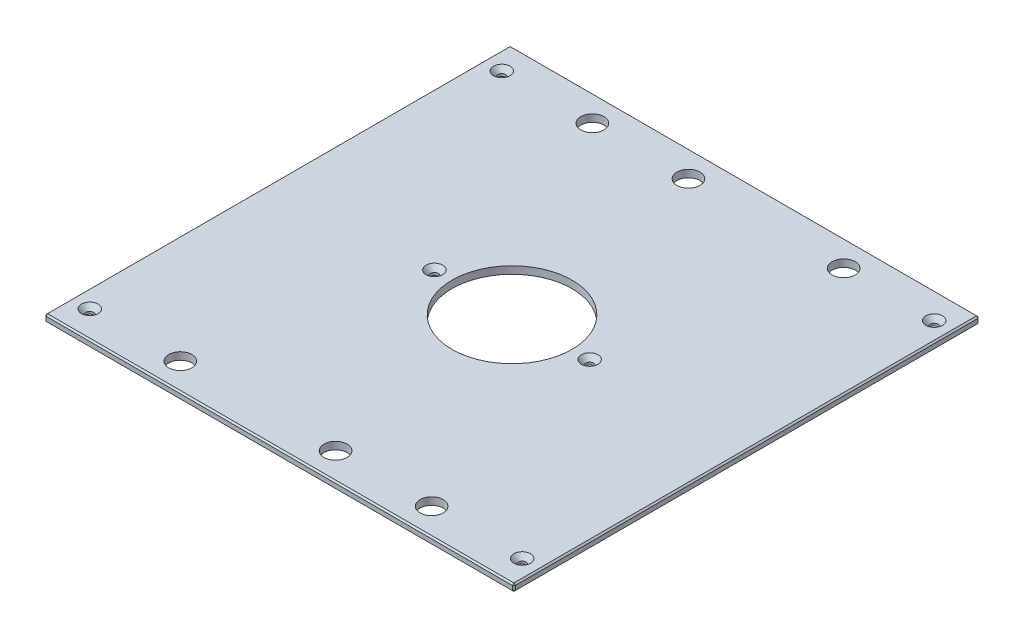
ISO-10303-21;
HEADER;
FILE_DESCRIPTION(('STEP AP214'),'2;1');
FILE_NAME('part.step','',(''),(''),'','','');
FILE_SCHEMA(('AUTOMOTIVE_DESIGN { 1 0 10303 214 1 1 1 1 }'));
ENDSEC;
DATA;
#1=APPLICATION_CONTEXT('core data for automotive mechanical design processes');
#2=APPLICATION_PROTOCOL_DEFINITION('international standard','automotive_design',2000,#1);
#3=PRODUCT_CONTEXT('',#1,'mechanical');
#4=PRODUCT('Part','Part','',(#3));
#5=PRODUCT_RELATED_PRODUCT_CATEGORY('part','',(#4));
#6=PRODUCT_DEFINITION_FORMATION('','',#4);
#7=PRODUCT_DEFINITION_CONTEXT('part definition',#1,'design');
#8=PRODUCT_DEFINITION('design','',#6,#7);
#9=PRODUCT_DEFINITION_SHAPE('','',#8);
#10=(LENGTH_UNIT() NAMED_UNIT(*) SI_UNIT(.MILLI.,.METRE.));
#11=(NAMED_UNIT(*) PLANE_ANGLE_UNIT() SI_UNIT($,.RADIAN.));
#12=(NAMED_UNIT(*) SI_UNIT($,.STERADIAN.) SOLID_ANGLE_UNIT());
#13=UNCERTAINTY_MEASURE_WITH_UNIT(LENGTH_MEASURE(1.E-05),#10,'distance_accuracy_value','');
#14=(GEOMETRIC_REPRESENTATION_CONTEXT(3) GLOBAL_UNCERTAINTY_ASSIGNED_CONTEXT((#13)) GLOBAL_UNIT_ASSIGNED_CONTEXT((#10,
#11,#12)) REPRESENTATION_CONTEXT('',''));
#15=CARTESIAN_POINT('',(0.,0.,0.));
#16=DIRECTION('',(0.,0.,1.));
#17=DIRECTION('',(1.,0.,0.));
#18=AXIS2_PLACEMENT_3D('',#15,#16,#17);
#19=CARTESIAN_POINT('',(-201.6125,6.35,-200.025));
#20=DIRECTION('',(1.,0.,0.));
#21=DIRECTION('',(0.,0.,-1.));
#22=AXIS2_PLACEMENT_3D('',#19,#20,#21);
#23=PLANE('',#22);
#24=DIRECTION('',(0.,0.,-1.));
#25=VECTOR('',#24,1.);
#26=CARTESIAN_POINT('',(-201.6125,5.08000000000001,-200.025));
#27=LINE('',#26,#25);
#28=CARTESIAN_POINT('',(-201.6125,5.08000000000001,198.755));
#29=VERTEX_POINT('',#28);
#30=CARTESIAN_POINT('',(-201.6125,5.08000000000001,-198.755));
#31=VERTEX_POINT('',#30);
#32=EDGE_CURVE('E135',#29,#31,#27,.T.);
#33=ORIENTED_EDGE('',*,*,#32,.T.);
#34=DIRECTION('',(0.,-1.,0.));
#35=VECTOR('',#34,1.);
#36=CARTESIAN_POINT('',(-201.6125,6.35,-198.755));
#37=LINE('',#36,#35);
#38=CARTESIAN_POINT('',(-201.6125,1.26999999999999,-198.755));
#39=VERTEX_POINT('',#38);
#40=EDGE_CURVE('E131',#31,#39,#37,.T.);
#41=ORIENTED_EDGE('',*,*,#40,.T.);
#42=DIRECTION('',(0.,0.,1.));
#43=VECTOR('',#42,1.);
#44=CARTESIAN_POINT('',(-201.6125,1.26999999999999,-200.025));
#45=LINE('',#44,#43);
#46=CARTESIAN_POINT('',(-201.6125,1.26999999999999,198.755));
#47=VERTEX_POINT('',#46);
#48=EDGE_CURVE('E126',#39,#47,#45,.T.);
#49=ORIENTED_EDGE('',*,*,#48,.T.);
#50=DIRECTION('',(0.,1.,0.));
#51=VECTOR('',#50,1.);
#52=CARTESIAN_POINT('',(-201.6125,6.35,198.755));
#53=LINE('',#52,#51);
#54=EDGE_CURVE('E128',#47,#29,#53,.T.);
#55=ORIENTED_EDGE('',*,*,#54,.T.);
#56=EDGE_LOOP('',(#33,#41,#49,#55));
#57=FACE_BOUND('',#56,.T.);
#58=ADVANCED_FACE('F35',(#57),#23,.F.);
#59=CARTESIAN_POINT('',(-201.6125,6.35,200.025));
#60=DIRECTION('',(0.,0.,-1.));
#61=DIRECTION('',(-1.,0.,0.));
#62=AXIS2_PLACEMENT_3D('',#59,#60,#61);
#63=PLANE('',#62);
#64=DIRECTION('',(1.,0.,0.));
#65=VECTOR('',#64,1.);
#66=CARTESIAN_POINT('',(-201.6125,1.26999999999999,200.025));
#67=LINE('',#66,#65);
#68=CARTESIAN_POINT('',(-200.3425,1.26999999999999,200.025));
#69=VERTEX_POINT('',#68);
#70=CARTESIAN_POINT('',(200.3425,1.26999999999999,200.025));
#71=VERTEX_POINT('',#70);
#72=EDGE_CURVE('E58',#69,#71,#67,.T.);
#73=ORIENTED_EDGE('',*,*,#72,.T.);
#74=DIRECTION('',(0.,1.,0.));
#75=VECTOR('',#74,1.);
#76=CARTESIAN_POINT('',(200.3425,6.35,200.025));
#77=LINE('',#76,#75);
#78=CARTESIAN_POINT('',(200.3425,5.08000000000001,200.025));
#79=VERTEX_POINT('',#78);
#80=EDGE_CURVE('E11',#71,#79,#77,.T.);
#81=ORIENTED_EDGE('',*,*,#80,.T.);
#82=DIRECTION('',(-1.,0.,0.));
#83=VECTOR('',#82,1.);
#84=CARTESIAN_POINT('',(-201.6125,5.08000000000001,200.025));
#85=LINE('',#84,#83);
#86=CARTESIAN_POINT('',(-200.3425,5.08000000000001,200.025));
#87=VERTEX_POINT('',#86);
#88=EDGE_CURVE('E44',#79,#87,#85,.T.);
#89=ORIENTED_EDGE('',*,*,#88,.T.);
#90=DIRECTION('',(0.,-1.,0.));
#91=VECTOR('',#90,1.);
#92=CARTESIAN_POINT('',(-200.3425,6.35,200.025));
#93=LINE('',#92,#91);
#94=EDGE_CURVE('E291',#87,#69,#93,.T.);
#95=ORIENTED_EDGE('',*,*,#94,.T.);
#96=EDGE_LOOP('',(#73,#81,#89,#95));
#97=FACE_BOUND('',#96,.T.);
#98=ADVANCED_FACE('F360',(#97),#63,.F.);
#99=CARTESIAN_POINT('',(201.6125,6.35,-200.025));
#100=DIRECTION('',(-1.,0.,0.));
#101=DIRECTION('',(0.,0.,1.));
#102=AXIS2_PLACEMENT_3D('',#99,#100,#101);
#103=PLANE('',#102);
#104=DIRECTION('',(0.,0.,-1.));
#105=VECTOR('',#104,1.);
#106=CARTESIAN_POINT('',(201.6125,1.26999999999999,-200.025));
#107=LINE('',#106,#105);
#108=CARTESIAN_POINT('',(201.6125,1.26999999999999,198.755));
#109=VERTEX_POINT('',#108);
#110=CARTESIAN_POINT('',(201.6125,1.26999999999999,-198.755));
#111=VERTEX_POINT('',#110);
#112=EDGE_CURVE('E286',#109,#111,#107,.T.);
#113=ORIENTED_EDGE('',*,*,#112,.T.);
#114=DIRECTION('',(0.,1.,0.));
#115=VECTOR('',#114,1.);
#116=CARTESIAN_POINT('',(201.6125,6.35,-198.755));
#117=LINE('',#116,#115);
#118=CARTESIAN_POINT('',(201.6125,5.08000000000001,-198.755));
#119=VERTEX_POINT('',#118);
#120=EDGE_CURVE('E288',#111,#119,#117,.T.);
#121=ORIENTED_EDGE('',*,*,#120,.T.);
#122=DIRECTION('',(0.,0.,1.));
#123=VECTOR('',#122,1.);
#124=CARTESIAN_POINT('',(201.6125,5.08000000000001,200.025));
#125=LINE('',#124,#123);
#126=CARTESIAN_POINT('',(201.6125,5.08000000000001,198.755));
#127=VERTEX_POINT('',#126);
#128=EDGE_CURVE('E284',#119,#127,#125,.T.);
#129=ORIENTED_EDGE('',*,*,#128,.T.);
#130=DIRECTION('',(0.,-1.,0.));
#131=VECTOR('',#130,1.);
#132=CARTESIAN_POINT('',(201.6125,6.35,198.755));
#133=LINE('',#132,#131);
#134=EDGE_CURVE('E282',#127,#109,#133,.T.);
#135=ORIENTED_EDGE('',*,*,#134,.T.);
#136=EDGE_LOOP('',(#113,#121,#129,#135));
#137=FACE_BOUND('',#136,.T.);
#138=ADVANCED_FACE('F347',(#137),#103,.F.);
#139=CARTESIAN_POINT('',(-201.6125,6.35,-200.025));
#140=DIRECTION('',(0.,0.,1.));
#141=DIRECTION('',(1.,0.,0.));
#142=AXIS2_PLACEMENT_3D('',#139,#140,#141);
#143=PLANE('',#142);
#144=DIRECTION('',(-1.,0.,0.));
#145=VECTOR('',#144,1.);
#146=CARTESIAN_POINT('',(-201.6125,1.26999999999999,-200.025));
#147=LINE('',#146,#145);
#148=CARTESIAN_POINT('',(200.3425,1.26999999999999,-200.025));
#149=VERTEX_POINT('',#148);
#150=CARTESIAN_POINT('',(-200.3425,1.26999999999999,-200.025));
#151=VERTEX_POINT('',#150);
#152=EDGE_CURVE('E258',#149,#151,#147,.T.);
#153=ORIENTED_EDGE('',*,*,#152,.T.);
#154=DIRECTION('',(0.,1.,0.));
#155=VECTOR('',#154,1.);
#156=CARTESIAN_POINT('',(-200.3425,6.35,-200.025));
#157=LINE('',#156,#155);
#158=CARTESIAN_POINT('',(-200.3425,5.08000000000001,-200.025));
#159=VERTEX_POINT('',#158);
#160=EDGE_CURVE('E262',#151,#159,#157,.T.);
#161=ORIENTED_EDGE('',*,*,#160,.T.);
#162=DIRECTION('',(1.,0.,0.));
#163=VECTOR('',#162,1.);
#164=CARTESIAN_POINT('',(201.6125,5.08000000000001,-200.025));
#165=LINE('',#164,#163);
#166=CARTESIAN_POINT('',(200.3425,5.08000000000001,-200.025));
#167=VERTEX_POINT('',#166);
#168=EDGE_CURVE('E260',#159,#167,#165,.T.);
#169=ORIENTED_EDGE('',*,*,#168,.T.);
#170=DIRECTION('',(0.,-1.,0.));
#171=VECTOR('',#170,1.);
#172=CARTESIAN_POINT('',(200.3425,6.35,-200.025));
#173=LINE('',#172,#171);
#174=EDGE_CURVE('E256',#167,#149,#173,.T.);
#175=ORIENTED_EDGE('',*,*,#174,.T.);
#176=EDGE_LOOP('',(#153,#161,#169,#175));
#177=FACE_BOUND('',#176,.T.);
#178=ADVANCED_FACE('F321',(#177),#143,.F.);
#179=CARTESIAN_POINT('',(0.,6.35,0.));
#180=DIRECTION('',(0.,1.,0.));
#181=DIRECTION('',(0.,0.,1.));
#182=AXIS2_PLACEMENT_3D('',#179,#180,#181);
#183=PLANE('',#182);
#184=CARTESIAN_POINT('',(185.7375,6.35,-177.00498));
#185=DIRECTION('',(0.,1.,0.));
#186=DIRECTION('',(0.,0.,1.));
#187=AXIS2_PLACEMENT_3D('',#184,#185,#186);
#188=CIRCLE('',#187,7.13739999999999);
#189=CARTESIAN_POINT('',(185.7375,6.35,-169.86758));
#190=VERTEX_POINT('',#189);
#191=EDGE_CURVE('E784',#190,#190,#188,.T.);
#192=ORIENTED_EDGE('',*,*,#191,.F.);
#193=EDGE_LOOP('',(#192));
#194=FACE_BOUND('',#193,.T.);
#195=CARTESIAN_POINT('',(185.7375,6.35,177.00498));
#196=DIRECTION('',(0.,1.,0.));
#197=DIRECTION('',(0.,0.,1.));
#198=AXIS2_PLACEMENT_3D('',#195,#196,#197);
#199=CIRCLE('',#198,7.13739999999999);
#200=CARTESIAN_POINT('',(185.7375,6.35,184.14238));
#201=VERTEX_POINT('',#200);
#202=EDGE_CURVE('E788',#201,#201,#199,.T.);
#203=ORIENTED_EDGE('',*,*,#202,.F.);
#204=EDGE_LOOP('',(#203));
#205=FACE_BOUND('',#204,.T.);
#206=CARTESIAN_POINT('',(-185.7375,6.35,177.00498));
#207=DIRECTION('',(0.,1.,0.));
#208=DIRECTION('',(0.,0.,1.));
#209=AXIS2_PLACEMENT_3D('',#206,#207,#208);
#210=CIRCLE('',#209,7.13739999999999);
#211=CARTESIAN_POINT('',(-185.7375,6.35,184.14238));
#212=VERTEX_POINT('',#211);
#213=EDGE_CURVE('E792',#212,#212,#210,.T.);
#214=ORIENTED_EDGE('',*,*,#213,.F.);
#215=EDGE_LOOP('',(#214));
#216=FACE_BOUND('',#215,.T.);
#217=CARTESIAN_POINT('',(-66.675,6.35,0.));
#218=DIRECTION('',(0.,1.,0.));
#219=DIRECTION('',(0.,0.,1.));
#220=AXIS2_PLACEMENT_3D('',#217,#218,#219);
#221=CIRCLE('',#220,7.1374);
#222=CARTESIAN_POINT('',(-66.675,6.35,7.1374));
#223=VERTEX_POINT('',#222);
#224=EDGE_CURVE('E796',#223,#223,#221,.T.);
#225=ORIENTED_EDGE('',*,*,#224,.F.);
#226=EDGE_LOOP('',(#225));
#227=FACE_BOUND('',#226,.T.);
#228=CARTESIAN_POINT('',(66.675,6.35,0.));
#229=DIRECTION('',(0.,1.,0.));
#230=DIRECTION('',(0.,0.,1.));
#231=AXIS2_PLACEMENT_3D('',#228,#229,#230);
#232=CIRCLE('',#231,7.1374);
#233=CARTESIAN_POINT('',(66.675,6.35,7.1374));
#234=VERTEX_POINT('',#233);
#235=EDGE_CURVE('E800',#234,#234,#232,.T.);
#236=ORIENTED_EDGE('',*,*,#235,.F.);
#237=EDGE_LOOP('',(#236));
#238=FACE_BOUND('',#237,.T.);
#239=CARTESIAN_POINT('',(-185.7375,6.35,-177.00498));
#240=DIRECTION('',(0.,1.,0.));
#241=DIRECTION('',(0.,0.,1.));
#242=AXIS2_PLACEMENT_3D('',#239,#240,#241);
#243=CIRCLE('',#242,7.13739999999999);
#244=CARTESIAN_POINT('',(-185.7375,6.35,-169.86758));
#245=VERTEX_POINT('',#244);
#246=EDGE_CURVE('E803',#245,#245,#243,.T.);
#247=ORIENTED_EDGE('',*,*,#246,.F.);
#248=EDGE_LOOP('',(#247));
#249=FACE_BOUND('',#248,.T.);
#250=DIRECTION('',(0.,0.,-1.));
#251=VECTOR('',#250,1.);
#252=CARTESIAN_POINT('',(200.3425,6.35,-200.025));
#253=LINE('',#252,#251);
#254=CARTESIAN_POINT('',(200.3425,6.35,198.755));
#255=VERTEX_POINT('',#254);
#256=CARTESIAN_POINT('',(200.3425,6.35,-198.755));
#257=VERTEX_POINT('',#256);
#258=EDGE_CURVE('E269',#255,#257,#253,.T.);
#259=ORIENTED_EDGE('',*,*,#258,.T.);
#260=DIRECTION('',(-1.,0.,0.));
#261=VECTOR('',#260,1.);
#262=CARTESIAN_POINT('',(-201.6125,6.35,-198.755));
#263=LINE('',#262,#261);
#264=CARTESIAN_POINT('',(-200.3425,6.35,-198.755));
#265=VERTEX_POINT('',#264);
#266=EDGE_CURVE('E271',#257,#265,#263,.T.);
#267=ORIENTED_EDGE('',*,*,#266,.T.);
#268=DIRECTION('',(0.,0.,1.));
#269=VECTOR('',#268,1.);
#270=CARTESIAN_POINT('',(-200.3425,6.35,200.025));
#271=LINE('',#270,#269);
#272=CARTESIAN_POINT('',(-200.3425,6.35,198.755));
#273=VERTEX_POINT('',#272);
#274=EDGE_CURVE('E267',#265,#273,#271,.T.);
#275=ORIENTED_EDGE('',*,*,#274,.T.);
#276=DIRECTION('',(1.,0.,0.));
#277=VECTOR('',#276,1.);
#278=CARTESIAN_POINT('',(201.6125,6.35,198.755));
#279=LINE('',#278,#277);
#280=EDGE_CURVE('E265',#273,#255,#279,.T.);
#281=ORIENTED_EDGE('',*,*,#280,.T.);
#282=EDGE_LOOP('',(#259,#267,#275,#281));
#283=FACE_BOUND('',#282,.T.);
#284=CARTESIAN_POINT('',(107.95,6.35,-177.00498));
#285=DIRECTION('',(0.,1.,0.));
#286=DIRECTION('',(0.,0.,1.));
#287=AXIS2_PLACEMENT_3D('',#284,#285,#286);
#288=CIRCLE('',#287,9.921875);
#289=CARTESIAN_POINT('',(107.95,6.35,-167.083105));
#290=VERTEX_POINT('',#289);
#291=EDGE_CURVE('E204',#290,#290,#288,.T.);
#292=ORIENTED_EDGE('',*,*,#291,.F.);
#293=EDGE_LOOP('',(#292));
#294=FACE_BOUND('',#293,.T.);
#295=CARTESIAN_POINT('',(-107.95,6.35,-177.00498));
#296=DIRECTION('',(0.,1.,0.));
#297=DIRECTION('',(0.,0.,1.));
#298=AXIS2_PLACEMENT_3D('',#295,#296,#297);
#299=CIRCLE('',#298,9.921875);
#300=CARTESIAN_POINT('',(-107.95,6.35,-167.083105));
#301=VERTEX_POINT('',#300);
#302=EDGE_CURVE('E214',#301,#301,#299,.T.);
#303=ORIENTED_EDGE('',*,*,#302,.F.);
#304=EDGE_LOOP('',(#303));
#305=FACE_BOUND('',#304,.T.);
#306=CARTESIAN_POINT('',(107.95,6.35,177.00498));
#307=DIRECTION('',(0.,1.,0.));
#308=DIRECTION('',(0.,0.,1.));
#309=AXIS2_PLACEMENT_3D('',#306,#307,#308);
#310=CIRCLE('',#309,9.921875);
#311=CARTESIAN_POINT('',(107.95,6.35,186.926855));
#312=VERTEX_POINT('',#311);
#313=EDGE_CURVE('E225',#312,#312,#310,.T.);
#314=ORIENTED_EDGE('',*,*,#313,.F.);
#315=EDGE_LOOP('',(#314));
#316=FACE_BOUND('',#315,.T.);
#317=CARTESIAN_POINT('',(-107.95,6.35,177.00498));
#318=DIRECTION('',(0.,1.,0.));
#319=DIRECTION('',(0.,0.,1.));
#320=AXIS2_PLACEMENT_3D('',#317,#318,#319);
#321=CIRCLE('',#320,9.921875);
#322=CARTESIAN_POINT('',(-107.95,6.35,186.926855));
#323=VERTEX_POINT('',#322);
#324=EDGE_CURVE('E231',#323,#323,#321,.T.);
#325=ORIENTED_EDGE('',*,*,#324,.F.);
#326=EDGE_LOOP('',(#325));
#327=FACE_BOUND('',#326,.T.);
#328=CARTESIAN_POINT('',(-25.4,6.35,-177.00498));
#329=DIRECTION('',(0.,1.,0.));
#330=DIRECTION('',(0.,0.,1.));
#331=AXIS2_PLACEMENT_3D('',#328,#329,#330);
#332=CIRCLE('',#331,9.921875);
#333=CARTESIAN_POINT('',(-25.4,6.35,-167.083105));
#334=VERTEX_POINT('',#333);
#335=EDGE_CURVE('E237',#334,#334,#332,.T.);
#336=ORIENTED_EDGE('',*,*,#335,.F.);
#337=EDGE_LOOP('',(#336));
#338=FACE_BOUND('',#337,.T.);
#339=CARTESIAN_POINT('',(25.4,6.35,177.00498));
#340=DIRECTION('',(0.,1.,0.));
#341=DIRECTION('',(0.,0.,1.));
#342=AXIS2_PLACEMENT_3D('',#339,#340,#341);
#343=CIRCLE('',#342,9.921875);
#344=CARTESIAN_POINT('',(25.4,6.35,186.926855));
#345=VERTEX_POINT('',#344);
#346=EDGE_CURVE('E243',#345,#345,#343,.T.);
#347=ORIENTED_EDGE('',*,*,#346,.F.);
#348=EDGE_LOOP('',(#347));
#349=FACE_BOUND('',#348,.T.);
#350=CARTESIAN_POINT('',(0.,6.35,0.));
#351=DIRECTION('',(0.,1.,0.));
#352=DIRECTION('',(0.,0.,1.));
#353=AXIS2_PLACEMENT_3D('',#350,#351,#352);
#354=CIRCLE('',#353,51.562);
#355=CARTESIAN_POINT('',(0.,6.35,51.562));
#356=VERTEX_POINT('',#355);
#357=EDGE_CURVE('E249',#356,#356,#354,.T.);
#358=ORIENTED_EDGE('',*,*,#357,.F.);
#359=EDGE_LOOP('',(#358));
#360=FACE_BOUND('',#359,.T.);
#361=ADVANCED_FACE('F369',(#194,#205,#216,#227,#238,#249,#283,#294,#305,#316,#327,#338,#349,
#360),#183,.T.);
#362=CARTESIAN_POINT('',(0.,0.,0.));
#363=DIRECTION('',(0.,1.,0.));
#364=DIRECTION('',(0.,0.,1.));
#365=AXIS2_PLACEMENT_3D('',#362,#363,#364);
#366=PLANE('',#365);
#367=CARTESIAN_POINT('',(185.7375,0.,-177.00498));
#368=DIRECTION('',(0.,1.,0.));
#369=DIRECTION('',(0.,0.,1.));
#370=AXIS2_PLACEMENT_3D('',#367,#368,#369);
#371=CIRCLE('',#370,3.3782);
#372=CARTESIAN_POINT('',(185.7375,0.,-173.62678));
#373=VERTEX_POINT('',#372);
#374=EDGE_CURVE('E837',#373,#373,#371,.T.);
#375=ORIENTED_EDGE('',*,*,#374,.T.);
#376=EDGE_LOOP('',(#375));
#377=FACE_BOUND('',#376,.T.);
#378=CARTESIAN_POINT('',(185.7375,0.,177.00498));
#379=DIRECTION('',(0.,1.,0.));
#380=DIRECTION('',(0.,0.,1.));
#381=AXIS2_PLACEMENT_3D('',#378,#379,#380);
#382=CIRCLE('',#381,3.3782);
#383=CARTESIAN_POINT('',(185.7375,0.,180.38318));
#384=VERTEX_POINT('',#383);
#385=EDGE_CURVE('E830',#384,#384,#382,.T.);
#386=ORIENTED_EDGE('',*,*,#385,.T.);
#387=EDGE_LOOP('',(#386));
#388=FACE_BOUND('',#387,.T.);
#389=CARTESIAN_POINT('',(-185.7375,0.,177.00498));
#390=DIRECTION('',(0.,1.,0.));
#391=DIRECTION('',(0.,0.,1.));
#392=AXIS2_PLACEMENT_3D('',#389,#390,#391);
#393=CIRCLE('',#392,3.3782);
#394=CARTESIAN_POINT('',(-185.7375,0.,180.38318));
#395=VERTEX_POINT('',#394);
#396=EDGE_CURVE('E823',#395,#395,#393,.T.);
#397=ORIENTED_EDGE('',*,*,#396,.T.);
#398=EDGE_LOOP('',(#397));
#399=FACE_BOUND('',#398,.T.);
#400=CARTESIAN_POINT('',(-66.675,0.,0.));
#401=DIRECTION('',(0.,1.,0.));
#402=DIRECTION('',(0.,0.,1.));
#403=AXIS2_PLACEMENT_3D('',#400,#401,#402);
#404=CIRCLE('',#403,3.3782);
#405=CARTESIAN_POINT('',(-66.675,0.,3.3782));
#406=VERTEX_POINT('',#405);
#407=EDGE_CURVE('E816',#406,#406,#404,.T.);
#408=ORIENTED_EDGE('',*,*,#407,.T.);
#409=EDGE_LOOP('',(#408));
#410=FACE_BOUND('',#409,.T.);
#411=CARTESIAN_POINT('',(66.675,0.,0.));
#412=DIRECTION('',(0.,1.,0.));
#413=DIRECTION('',(0.,0.,1.));
#414=AXIS2_PLACEMENT_3D('',#411,#412,#413);
#415=CIRCLE('',#414,3.3782);
#416=CARTESIAN_POINT('',(66.675,0.,3.3782));
#417=VERTEX_POINT('',#416);
#418=EDGE_CURVE('E806',#417,#417,#415,.T.);
#419=ORIENTED_EDGE('',*,*,#418,.T.);
#420=EDGE_LOOP('',(#419));
#421=FACE_BOUND('',#420,.T.);
#422=CARTESIAN_POINT('',(-185.7375,0.,-177.00498));
#423=DIRECTION('',(0.,1.,0.));
#424=DIRECTION('',(0.,0.,1.));
#425=AXIS2_PLACEMENT_3D('',#422,#423,#424);
#426=CIRCLE('',#425,3.3782);
#427=CARTESIAN_POINT('',(-185.7375,0.,-173.62678));
#428=VERTEX_POINT('',#427);
#429=EDGE_CURVE('E217',#428,#428,#426,.T.);
#430=ORIENTED_EDGE('',*,*,#429,.T.);
#431=EDGE_LOOP('',(#430));
#432=FACE_BOUND('',#431,.T.);
#433=DIRECTION('',(0.,0.,-1.));
#434=VECTOR('',#433,1.);
#435=CARTESIAN_POINT('',(-200.3425,0.,0.));
#436=LINE('',#435,#434);
#437=CARTESIAN_POINT('',(-200.3425,0.,198.755));
#438=VERTEX_POINT('',#437);
#439=CARTESIAN_POINT('',(-200.3425,0.,-198.755));
#440=VERTEX_POINT('',#439);
#441=EDGE_CURVE('E158',#438,#440,#436,.T.);
#442=ORIENTED_EDGE('',*,*,#441,.T.);
#443=DIRECTION('',(1.,0.,0.));
#444=VECTOR('',#443,1.);
#445=CARTESIAN_POINT('',(0.,0.,-198.755));
#446=LINE('',#445,#444);
#447=CARTESIAN_POINT('',(200.3425,0.,-198.755));
#448=VERTEX_POINT('',#447);
#449=EDGE_CURVE('E279',#440,#448,#446,.T.);
#450=ORIENTED_EDGE('',*,*,#449,.T.);
#451=DIRECTION('',(0.,0.,1.));
#452=VECTOR('',#451,1.);
#453=CARTESIAN_POINT('',(200.3425,0.,0.));
#454=LINE('',#453,#452);
#455=CARTESIAN_POINT('',(200.3425,0.,198.755));
#456=VERTEX_POINT('',#455);
#457=EDGE_CURVE('E277',#448,#456,#454,.T.);
#458=ORIENTED_EDGE('',*,*,#457,.T.);
#459=DIRECTION('',(-1.,0.,0.));
#460=VECTOR('',#459,1.);
#461=CARTESIAN_POINT('',(0.,0.,198.755));
#462=LINE('',#461,#460);
#463=EDGE_CURVE('E274',#456,#438,#462,.T.);
#464=ORIENTED_EDGE('',*,*,#463,.T.);
#465=EDGE_LOOP('',(#442,#450,#458,#464));
#466=FACE_BOUND('',#465,.T.);
#467=CARTESIAN_POINT('',(107.95,0.,-177.00498));
#468=DIRECTION('',(0.,1.,0.));
#469=DIRECTION('',(0.,0.,1.));
#470=AXIS2_PLACEMENT_3D('',#467,#468,#469);
#471=CIRCLE('',#470,9.921875);
#472=CARTESIAN_POINT('',(107.95,0.,-167.083105));
#473=VERTEX_POINT('',#472);
#474=EDGE_CURVE('E209',#473,#473,#471,.T.);
#475=ORIENTED_EDGE('',*,*,#474,.T.);
#476=EDGE_LOOP('',(#475));
#477=FACE_BOUND('',#476,.T.);
#478=CARTESIAN_POINT('',(-107.95,0.,-177.00498));
#479=DIRECTION('',(0.,1.,0.));
#480=DIRECTION('',(0.,0.,1.));
#481=AXIS2_PLACEMENT_3D('',#478,#479,#480);
#482=CIRCLE('',#481,9.921875);
#483=CARTESIAN_POINT('',(-107.95,0.,-167.083105));
#484=VERTEX_POINT('',#483);
#485=EDGE_CURVE('E222',#484,#484,#482,.T.);
#486=ORIENTED_EDGE('',*,*,#485,.T.);
#487=EDGE_LOOP('',(#486));
#488=FACE_BOUND('',#487,.T.);
#489=CARTESIAN_POINT('',(107.95,0.,177.00498));
#490=DIRECTION('',(0.,1.,0.));
#491=DIRECTION('',(0.,0.,1.));
#492=AXIS2_PLACEMENT_3D('',#489,#490,#491);
#493=CIRCLE('',#492,9.921875);
#494=CARTESIAN_POINT('',(107.95,0.,186.926855));
#495=VERTEX_POINT('',#494);
#496=EDGE_CURVE('E228',#495,#495,#493,.T.);
#497=ORIENTED_EDGE('',*,*,#496,.T.);
#498=EDGE_LOOP('',(#497));
#499=FACE_BOUND('',#498,.T.);
#500=CARTESIAN_POINT('',(-107.95,0.,177.00498));
#501=DIRECTION('',(0.,1.,0.));
#502=DIRECTION('',(0.,0.,1.));
#503=AXIS2_PLACEMENT_3D('',#500,#501,#502);
#504=CIRCLE('',#503,9.921875);
#505=CARTESIAN_POINT('',(-107.95,0.,186.926855));
#506=VERTEX_POINT('',#505);
#507=EDGE_CURVE('E234',#506,#506,#504,.T.);
#508=ORIENTED_EDGE('',*,*,#507,.T.);
#509=EDGE_LOOP('',(#508));
#510=FACE_BOUND('',#509,.T.);
#511=CARTESIAN_POINT('',(-25.4,0.,-177.00498));
#512=DIRECTION('',(0.,1.,0.));
#513=DIRECTION('',(0.,0.,1.));
#514=AXIS2_PLACEMENT_3D('',#511,#512,#513);
#515=CIRCLE('',#514,9.921875);
#516=CARTESIAN_POINT('',(-25.4,0.,-167.083105));
#517=VERTEX_POINT('',#516);
#518=EDGE_CURVE('E240',#517,#517,#515,.T.);
#519=ORIENTED_EDGE('',*,*,#518,.T.);
#520=EDGE_LOOP('',(#519));
#521=FACE_BOUND('',#520,.T.);
#522=CARTESIAN_POINT('',(25.4,0.,177.00498));
#523=DIRECTION('',(0.,1.,0.));
#524=DIRECTION('',(0.,0.,1.));
#525=AXIS2_PLACEMENT_3D('',#522,#523,#524);
#526=CIRCLE('',#525,9.921875);
#527=CARTESIAN_POINT('',(25.4,0.,186.926855));
#528=VERTEX_POINT('',#527);
#529=EDGE_CURVE('E246',#528,#528,#526,.T.);
#530=ORIENTED_EDGE('',*,*,#529,.T.);
#531=EDGE_LOOP('',(#530));
#532=FACE_BOUND('',#531,.T.);
#533=CARTESIAN_POINT('',(0.,0.,0.));
#534=DIRECTION('',(0.,1.,0.));
#535=DIRECTION('',(0.,0.,1.));
#536=AXIS2_PLACEMENT_3D('',#533,#534,#535);
#537=CIRCLE('',#536,51.562);
#538=CARTESIAN_POINT('',(0.,0.,51.562));
#539=VERTEX_POINT('',#538);
#540=EDGE_CURVE('E147',#539,#539,#537,.T.);
#541=ORIENTED_EDGE('',*,*,#540,.T.);
#542=EDGE_LOOP('',(#541));
#543=FACE_BOUND('',#542,.T.);
#544=ADVANCED_FACE('F334',(#377,#388,#399,#410,#421,#432,#466,#477,#488,#499,#510,#521,#532,
#543),#366,.F.);
#545=CARTESIAN_POINT('',(0.,0.,0.));
#546=DIRECTION('',(0.,1.,0.));
#547=DIRECTION('',(0.,0.,1.));
#548=AXIS2_PLACEMENT_3D('',#545,#546,#547);
#549=CYLINDRICAL_SURFACE('',#548,51.562);
#550=ORIENTED_EDGE('',*,*,#540,.F.);
#551=EDGE_LOOP('',(#550));
#552=FACE_BOUND('',#551,.T.);
#553=ORIENTED_EDGE('',*,*,#357,.T.);
#554=EDGE_LOOP('',(#553));
#555=FACE_BOUND('',#554,.T.);
#556=ADVANCED_FACE('F721',(#552,#555),#549,.F.);
#557=CARTESIAN_POINT('',(25.4,6.35,177.00498));
#558=DIRECTION('',(0.,1.,0.));
#559=DIRECTION('',(0.,0.,1.));
#560=AXIS2_PLACEMENT_3D('',#557,#558,#559);
#561=CYLINDRICAL_SURFACE('',#560,9.921875);
#562=ORIENTED_EDGE('',*,*,#529,.F.);
#563=EDGE_LOOP('',(#562));
#564=FACE_BOUND('',#563,.T.);
#565=ORIENTED_EDGE('',*,*,#346,.T.);
#566=EDGE_LOOP('',(#565));
#567=FACE_BOUND('',#566,.T.);
#568=ADVANCED_FACE('F712',(#564,#567),#561,.F.);
#569=CARTESIAN_POINT('',(-25.4,6.35,-177.00498));
#570=DIRECTION('',(0.,1.,0.));
#571=DIRECTION('',(0.,0.,1.));
#572=AXIS2_PLACEMENT_3D('',#569,#570,#571);
#573=CYLINDRICAL_SURFACE('',#572,9.921875);
#574=ORIENTED_EDGE('',*,*,#518,.F.);
#575=EDGE_LOOP('',(#574));
#576=FACE_BOUND('',#575,.T.);
#577=ORIENTED_EDGE('',*,*,#335,.T.);
#578=EDGE_LOOP('',(#577));
#579=FACE_BOUND('',#578,.T.);
#580=ADVANCED_FACE('F703',(#576,#579),#573,.F.);
#581=CARTESIAN_POINT('',(-107.95,6.35,177.00498));
#582=DIRECTION('',(0.,1.,0.));
#583=DIRECTION('',(0.,0.,1.));
#584=AXIS2_PLACEMENT_3D('',#581,#582,#583);
#585=CYLINDRICAL_SURFACE('',#584,9.921875);
#586=ORIENTED_EDGE('',*,*,#507,.F.);
#587=EDGE_LOOP('',(#586));
#588=FACE_BOUND('',#587,.T.);
#589=ORIENTED_EDGE('',*,*,#324,.T.);
#590=EDGE_LOOP('',(#589));
#591=FACE_BOUND('',#590,.T.);
#592=ADVANCED_FACE('F694',(#588,#591),#585,.F.);
#593=CARTESIAN_POINT('',(107.95,6.35,177.00498));
#594=DIRECTION('',(0.,1.,0.));
#595=DIRECTION('',(0.,0.,1.));
#596=AXIS2_PLACEMENT_3D('',#593,#594,#595);
#597=CYLINDRICAL_SURFACE('',#596,9.921875);
#598=ORIENTED_EDGE('',*,*,#496,.F.);
#599=EDGE_LOOP('',(#598));
#600=FACE_BOUND('',#599,.T.);
#601=ORIENTED_EDGE('',*,*,#313,.T.);
#602=EDGE_LOOP('',(#601));
#603=FACE_BOUND('',#602,.T.);
#604=ADVANCED_FACE('F685',(#600,#603),#597,.F.);
#605=CARTESIAN_POINT('',(-107.95,6.35,-177.00498));
#606=DIRECTION('',(0.,1.,0.));
#607=DIRECTION('',(0.,0.,1.));
#608=AXIS2_PLACEMENT_3D('',#605,#606,#607);
#609=CYLINDRICAL_SURFACE('',#608,9.921875);
#610=ORIENTED_EDGE('',*,*,#485,.F.);
#611=EDGE_LOOP('',(#610));
#612=FACE_BOUND('',#611,.T.);
#613=ORIENTED_EDGE('',*,*,#302,.T.);
#614=EDGE_LOOP('',(#613));
#615=FACE_BOUND('',#614,.T.);
#616=ADVANCED_FACE('F675',(#612,#615),#609,.F.);
#617=CARTESIAN_POINT('',(107.95,6.35,-177.00498));
#618=DIRECTION('',(0.,1.,0.));
#619=DIRECTION('',(0.,0.,1.));
#620=AXIS2_PLACEMENT_3D('',#617,#618,#619);
#621=CYLINDRICAL_SURFACE('',#620,9.921875);
#622=ORIENTED_EDGE('',*,*,#474,.F.);
#623=EDGE_LOOP('',(#622));
#624=FACE_BOUND('',#623,.T.);
#625=ORIENTED_EDGE('',*,*,#291,.T.);
#626=EDGE_LOOP('',(#625));
#627=FACE_BOUND('',#626,.T.);
#628=ADVANCED_FACE('F378',(#624,#627),#621,.F.);
#629=CARTESIAN_POINT('',(201.6125,6.35,198.755));
#630=DIRECTION('',(-0.707106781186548,0.,-0.707106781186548));
#631=DIRECTION('',(0.,-1.,0.));
#632=AXIS2_PLACEMENT_3D('',#629,#630,#631);
#633=PLANE('',#632);
#634=DIRECTION('',(-0.707106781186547,0.,0.707106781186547));
#635=VECTOR('',#634,1.);
#636=CARTESIAN_POINT('',(201.6125,5.08000000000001,198.755));
#637=LINE('',#636,#635);
#638=EDGE_CURVE('E39',#79,#127,#637,.F.);
#639=ORIENTED_EDGE('',*,*,#638,.F.);
#640=ORIENTED_EDGE('',*,*,#80,.F.);
#641=DIRECTION('',(0.707106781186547,0.,-0.707106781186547));
#642=VECTOR('',#641,1.);
#643=CARTESIAN_POINT('',(200.9775,1.26999999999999,199.39));
#644=LINE('',#643,#642);
#645=EDGE_CURVE('E197',#109,#71,#644,.F.);
#646=ORIENTED_EDGE('',*,*,#645,.F.);
#647=ORIENTED_EDGE('',*,*,#134,.F.);
#648=EDGE_LOOP('',(#639,#640,#646,#647));
#649=FACE_BOUND('',#648,.T.);
#650=ADVANCED_FACE('F37',(#649),#633,.F.);
#651=CARTESIAN_POINT('',(201.6125,5.08000000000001,198.755));
#652=DIRECTION('',(0.577350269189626,0.577350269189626,0.577350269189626));
#653=DIRECTION('',(0.707106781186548,0.,-0.707106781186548));
#654=AXIS2_PLACEMENT_3D('',#651,#652,#653);
#655=PLANE('',#654);
#656=DIRECTION('',(0.,-0.707106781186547,0.707106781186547));
#657=VECTOR('',#656,1.);
#658=CARTESIAN_POINT('',(200.3425,5.715,199.39));
#659=LINE('',#658,#657);
#660=EDGE_CURVE('E193',#79,#255,#659,.F.);
#661=ORIENTED_EDGE('',*,*,#660,.F.);
#662=ORIENTED_EDGE('',*,*,#638,.T.);
#663=DIRECTION('',(-0.707106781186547,0.707106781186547,0.));
#664=VECTOR('',#663,1.);
#665=CARTESIAN_POINT('',(201.6125,5.08000000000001,198.755));
#666=LINE('',#665,#664);
#667=EDGE_CURVE('E195',#255,#127,#666,.F.);
#668=ORIENTED_EDGE('',*,*,#667,.F.);
#669=EDGE_LOOP('',(#661,#662,#668));
#670=FACE_BOUND('',#669,.T.);
#671=ADVANCED_FACE('F371',(#670),#655,.T.);
#672=CARTESIAN_POINT('',(200.3425,0.,198.755));
#673=DIRECTION('',(0.577350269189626,-0.577350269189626,0.577350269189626));
#674=DIRECTION('',(0.707106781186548,0.,-0.707106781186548));
#675=AXIS2_PLACEMENT_3D('',#672,#673,#674);
#676=PLANE('',#675);
#677=DIRECTION('',(-0.707106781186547,-0.707106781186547,0.));
#678=VECTOR('',#677,1.);
#679=CARTESIAN_POINT('',(200.3425,0.,198.755));
#680=LINE('',#679,#678);
#681=EDGE_CURVE('E187',#109,#456,#680,.T.);
#682=ORIENTED_EDGE('',*,*,#681,.F.);
#683=ORIENTED_EDGE('',*,*,#645,.T.);
#684=DIRECTION('',(0.,0.707106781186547,0.707106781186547));
#685=VECTOR('',#684,1.);
#686=CARTESIAN_POINT('',(200.3425,0.,198.755));
#687=LINE('',#686,#685);
#688=EDGE_CURVE('E190',#456,#71,#687,.T.);
#689=ORIENTED_EDGE('',*,*,#688,.F.);
#690=EDGE_LOOP('',(#682,#683,#689));
#691=FACE_BOUND('',#690,.T.);
#692=ADVANCED_FACE('F340',(#691),#676,.T.);
#693=CARTESIAN_POINT('',(200.3425,6.35,0.));
#694=DIRECTION('',(0.707106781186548,0.707106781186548,0.));
#695=DIRECTION('',(0.,0.,1.));
#696=AXIS2_PLACEMENT_3D('',#693,#694,#695);
#697=PLANE('',#696);
#698=ORIENTED_EDGE('',*,*,#667,.T.);
#699=ORIENTED_EDGE('',*,*,#128,.F.);
#700=DIRECTION('',(0.707106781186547,-0.707106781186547,0.));
#701=VECTOR('',#700,1.);
#702=CARTESIAN_POINT('',(200.9775,5.715,-198.755));
#703=LINE('',#702,#701);
#704=EDGE_CURVE('E182',#257,#119,#703,.T.);
#705=ORIENTED_EDGE('',*,*,#704,.F.);
#706=ORIENTED_EDGE('',*,*,#258,.F.);
#707=EDGE_LOOP('',(#698,#699,#705,#706));
#708=FACE_BOUND('',#707,.T.);
#709=ADVANCED_FACE('F357',(#708),#697,.T.);
#710=CARTESIAN_POINT('',(0.,6.35,198.755));
#711=DIRECTION('',(0.,0.707106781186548,0.707106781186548));
#712=DIRECTION('',(-1.,0.,0.));
#713=AXIS2_PLACEMENT_3D('',#710,#711,#712);
#714=PLANE('',#713);
#715=ORIENTED_EDGE('',*,*,#660,.T.);
#716=ORIENTED_EDGE('',*,*,#280,.F.);
#717=DIRECTION('',(0.,0.707106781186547,-0.707106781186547));
#718=VECTOR('',#717,1.);
#719=CARTESIAN_POINT('',(-200.3425,6.35,198.755));
#720=LINE('',#719,#718);
#721=EDGE_CURVE('E179',#87,#273,#720,.T.);
#722=ORIENTED_EDGE('',*,*,#721,.F.);
#723=ORIENTED_EDGE('',*,*,#88,.F.);
#724=EDGE_LOOP('',(#715,#716,#722,#723));
#725=FACE_BOUND('',#724,.T.);
#726=ADVANCED_FACE('F362',(#725),#714,.T.);
#727=CARTESIAN_POINT('',(-200.3425,6.35,200.025));
#728=DIRECTION('',(0.707106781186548,0.,-0.707106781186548));
#729=DIRECTION('',(0.,-1.,0.));
#730=AXIS2_PLACEMENT_3D('',#727,#728,#729);
#731=PLANE('',#730);
#732=DIRECTION('',(0.707106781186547,0.,0.707106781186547));
#733=VECTOR('',#732,1.);
#734=CARTESIAN_POINT('',(-201.6125,1.26999999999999,198.755));
#735=LINE('',#734,#733);
#736=EDGE_CURVE('E142',#69,#47,#735,.F.);
#737=ORIENTED_EDGE('',*,*,#736,.F.);
#738=ORIENTED_EDGE('',*,*,#94,.F.);
#739=DIRECTION('',(-0.707106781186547,0.,-0.707106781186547));
#740=VECTOR('',#739,1.);
#741=CARTESIAN_POINT('',(-200.9775,5.08000000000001,199.39));
#742=LINE('',#741,#740);
#743=EDGE_CURVE('E145',#29,#87,#742,.F.);
#744=ORIENTED_EDGE('',*,*,#743,.F.);
#745=ORIENTED_EDGE('',*,*,#54,.F.);
#746=EDGE_LOOP('',(#737,#738,#744,#745));
#747=FACE_BOUND('',#746,.T.);
#748=ADVANCED_FACE('F140',(#747),#731,.F.);
#749=CARTESIAN_POINT('',(-201.6125,1.26999999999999,200.025));
#750=DIRECTION('',(0.,0.707106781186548,-0.707106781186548));
#751=DIRECTION('',(1.,0.,0.));
#752=AXIS2_PLACEMENT_3D('',#749,#750,#751);
#753=PLANE('',#752);
#754=ORIENTED_EDGE('',*,*,#688,.T.);
#755=ORIENTED_EDGE('',*,*,#72,.F.);
#756=DIRECTION('',(0.,-0.707106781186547,-0.707106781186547));
#757=VECTOR('',#756,1.);
#758=CARTESIAN_POINT('',(-200.3425,0.634999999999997,199.39));
#759=LINE('',#758,#757);
#760=EDGE_CURVE('E155',#438,#69,#759,.F.);
#761=ORIENTED_EDGE('',*,*,#760,.F.);
#762=ORIENTED_EDGE('',*,*,#463,.F.);
#763=EDGE_LOOP('',(#754,#755,#761,#762));
#764=FACE_BOUND('',#763,.T.);
#765=ADVANCED_FACE('F339',(#764),#753,.F.);
#766=CARTESIAN_POINT('',(201.6125,1.26999999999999,-200.025));
#767=DIRECTION('',(-0.707106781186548,0.707106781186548,0.));
#768=DIRECTION('',(0.,0.,-1.));
#769=AXIS2_PLACEMENT_3D('',#766,#767,#768);
#770=PLANE('',#769);
#771=ORIENTED_EDGE('',*,*,#681,.T.);
#772=ORIENTED_EDGE('',*,*,#457,.F.);
#773=DIRECTION('',(0.707106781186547,0.707106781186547,0.));
#774=VECTOR('',#773,1.);
#775=CARTESIAN_POINT('',(200.3425,0.,-198.755));
#776=LINE('',#775,#774);
#777=EDGE_CURVE('E174',#111,#448,#776,.F.);
#778=ORIENTED_EDGE('',*,*,#777,.F.);
#779=ORIENTED_EDGE('',*,*,#112,.F.);
#780=EDGE_LOOP('',(#771,#772,#778,#779));
#781=FACE_BOUND('',#780,.T.);
#782=ADVANCED_FACE('F344',(#781),#770,.F.);
#783=CARTESIAN_POINT('',(200.3425,6.35,-200.025));
#784=DIRECTION('',(-0.707106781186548,0.,0.707106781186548));
#785=DIRECTION('',(0.,-1.,0.));
#786=AXIS2_PLACEMENT_3D('',#783,#784,#785);
#787=PLANE('',#786);
#788=DIRECTION('',(0.707106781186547,0.,0.707106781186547));
#789=VECTOR('',#788,1.);
#790=CARTESIAN_POINT('',(200.3425,5.08000000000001,-200.025));
#791=LINE('',#790,#789);
#792=EDGE_CURVE('E184',#119,#167,#791,.F.);
#793=ORIENTED_EDGE('',*,*,#792,.F.);
#794=ORIENTED_EDGE('',*,*,#120,.F.);
#795=DIRECTION('',(-0.707106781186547,0.,-0.707106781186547));
#796=VECTOR('',#795,1.);
#797=CARTESIAN_POINT('',(200.9775,1.26999999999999,-199.39));
#798=LINE('',#797,#796);
#799=EDGE_CURVE('E171',#149,#111,#798,.F.);
#800=ORIENTED_EDGE('',*,*,#799,.F.);
#801=ORIENTED_EDGE('',*,*,#174,.F.);
#802=EDGE_LOOP('',(#793,#794,#800,#801));
#803=FACE_BOUND('',#802,.T.);
#804=ADVANCED_FACE('F352',(#803),#787,.F.);
#805=CARTESIAN_POINT('',(200.3425,5.08000000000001,-200.025));
#806=DIRECTION('',(0.577350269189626,0.577350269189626,-0.577350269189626));
#807=DIRECTION('',(-0.707106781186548,0.,-0.707106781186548));
#808=AXIS2_PLACEMENT_3D('',#805,#806,#807);
#809=PLANE('',#808);
#810=ORIENTED_EDGE('',*,*,#704,.T.);
#811=ORIENTED_EDGE('',*,*,#792,.T.);
#812=DIRECTION('',(0.,0.707106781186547,0.707106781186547));
#813=VECTOR('',#812,1.);
#814=CARTESIAN_POINT('',(200.3425,5.08000000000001,-200.025));
#815=LINE('',#814,#813);
#816=EDGE_CURVE('E163',#257,#167,#815,.F.);
#817=ORIENTED_EDGE('',*,*,#816,.F.);
#818=EDGE_LOOP('',(#810,#811,#817));
#819=FACE_BOUND('',#818,.T.);
#820=ADVANCED_FACE('F410',(#819),#809,.T.);
#821=CARTESIAN_POINT('',(-200.3425,6.35,198.755));
#822=DIRECTION('',(-0.577350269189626,0.577350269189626,0.577350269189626));
#823=DIRECTION('',(0.707106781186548,0.,0.707106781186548));
#824=AXIS2_PLACEMENT_3D('',#821,#822,#823);
#825=PLANE('',#824);
#826=ORIENTED_EDGE('',*,*,#743,.T.);
#827=ORIENTED_EDGE('',*,*,#721,.T.);
#828=DIRECTION('',(-0.707106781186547,-0.707106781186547,0.));
#829=VECTOR('',#828,1.);
#830=CARTESIAN_POINT('',(-200.3425,6.35,198.755));
#831=LINE('',#830,#829);
#832=EDGE_CURVE('E159',#29,#273,#831,.F.);
#833=ORIENTED_EDGE('',*,*,#832,.F.);
#834=EDGE_LOOP('',(#826,#827,#833));
#835=FACE_BOUND('',#834,.T.);
#836=ADVANCED_FACE('F364',(#835),#825,.T.);
#837=CARTESIAN_POINT('',(-201.6125,1.26999999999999,198.755));
#838=DIRECTION('',(-0.577350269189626,-0.577350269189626,0.577350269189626));
#839=DIRECTION('',(0.707106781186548,0.,0.707106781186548));
#840=AXIS2_PLACEMENT_3D('',#837,#838,#839);
#841=PLANE('',#840);
#842=ORIENTED_EDGE('',*,*,#760,.T.);
#843=ORIENTED_EDGE('',*,*,#736,.T.);
#844=DIRECTION('',(-0.707106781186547,0.707106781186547,0.));
#845=VECTOR('',#844,1.);
#846=CARTESIAN_POINT('',(-201.6125,1.26999999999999,198.755));
#847=LINE('',#846,#845);
#848=EDGE_CURVE('E152',#438,#47,#847,.T.);
#849=ORIENTED_EDGE('',*,*,#848,.F.);
#850=EDGE_LOOP('',(#842,#843,#849));
#851=FACE_BOUND('',#850,.T.);
#852=ADVANCED_FACE('F151',(#851),#841,.T.);
#853=CARTESIAN_POINT('',(200.3425,0.,-198.755));
#854=DIRECTION('',(0.577350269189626,-0.577350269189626,-0.577350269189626));
#855=DIRECTION('',(-0.707106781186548,0.,-0.707106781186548));
#856=AXIS2_PLACEMENT_3D('',#853,#854,#855);
#857=PLANE('',#856);
#858=ORIENTED_EDGE('',*,*,#799,.T.);
#859=ORIENTED_EDGE('',*,*,#777,.T.);
#860=DIRECTION('',(0.,-0.707106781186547,0.707106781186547));
#861=VECTOR('',#860,1.);
#862=CARTESIAN_POINT('',(200.3425,0.,-198.755));
#863=LINE('',#862,#861);
#864=EDGE_CURVE('E160',#149,#448,#863,.T.);
#865=ORIENTED_EDGE('',*,*,#864,.F.);
#866=EDGE_LOOP('',(#858,#859,#865));
#867=FACE_BOUND('',#866,.T.);
#868=ADVANCED_FACE('F402',(#867),#857,.T.);
#869=CARTESIAN_POINT('',(0.,6.35,-198.755));
#870=DIRECTION('',(0.,0.707106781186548,-0.707106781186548));
#871=DIRECTION('',(1.,0.,0.));
#872=AXIS2_PLACEMENT_3D('',#869,#870,#871);
#873=PLANE('',#872);
#874=ORIENTED_EDGE('',*,*,#816,.T.);
#875=ORIENTED_EDGE('',*,*,#168,.F.);
#876=DIRECTION('',(0.,-0.707106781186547,-0.707106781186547));
#877=VECTOR('',#876,1.);
#878=CARTESIAN_POINT('',(-200.3425,5.08000000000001,-200.025));
#879=LINE('',#878,#877);
#880=EDGE_CURVE('E165',#265,#159,#879,.T.);
#881=ORIENTED_EDGE('',*,*,#880,.F.);
#882=ORIENTED_EDGE('',*,*,#266,.F.);
#883=EDGE_LOOP('',(#874,#875,#881,#882));
#884=FACE_BOUND('',#883,.T.);
#885=ADVANCED_FACE('F316',(#884),#873,.T.);
#886=CARTESIAN_POINT('',(-200.3425,6.35,0.));
#887=DIRECTION('',(-0.707106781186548,0.707106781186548,0.));
#888=DIRECTION('',(0.,0.,-1.));
#889=AXIS2_PLACEMENT_3D('',#886,#887,#888);
#890=PLANE('',#889);
#891=ORIENTED_EDGE('',*,*,#832,.T.);
#892=ORIENTED_EDGE('',*,*,#274,.F.);
#893=DIRECTION('',(0.707106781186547,0.707106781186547,0.));
#894=VECTOR('',#893,1.);
#895=CARTESIAN_POINT('',(-200.9775,5.715,-198.755));
#896=LINE('',#895,#894);
#897=EDGE_CURVE('E305',#31,#265,#896,.T.);
#898=ORIENTED_EDGE('',*,*,#897,.F.);
#899=ORIENTED_EDGE('',*,*,#32,.F.);
#900=EDGE_LOOP('',(#891,#892,#898,#899));
#901=FACE_BOUND('',#900,.T.);
#902=ADVANCED_FACE('F367',(#901),#890,.T.);
#903=CARTESIAN_POINT('',(-201.6125,1.26999999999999,-200.025));
#904=DIRECTION('',(0.707106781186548,0.707106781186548,0.));
#905=DIRECTION('',(0.,0.,1.));
#906=AXIS2_PLACEMENT_3D('',#903,#904,#905);
#907=PLANE('',#906);
#908=ORIENTED_EDGE('',*,*,#848,.T.);
#909=ORIENTED_EDGE('',*,*,#48,.F.);
#910=DIRECTION('',(0.707106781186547,-0.707106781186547,0.));
#911=VECTOR('',#910,1.);
#912=CARTESIAN_POINT('',(-201.6125,1.26999999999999,-198.755));
#913=LINE('',#912,#911);
#914=EDGE_CURVE('E302',#440,#39,#913,.F.);
#915=ORIENTED_EDGE('',*,*,#914,.F.);
#916=ORIENTED_EDGE('',*,*,#441,.F.);
#917=EDGE_LOOP('',(#908,#909,#915,#916));
#918=FACE_BOUND('',#917,.T.);
#919=ADVANCED_FACE('F157',(#918),#907,.F.);
#920=CARTESIAN_POINT('',(-201.6125,1.26999999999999,-200.025));
#921=DIRECTION('',(0.,0.707106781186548,0.707106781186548));
#922=DIRECTION('',(-1.,0.,0.));
#923=AXIS2_PLACEMENT_3D('',#920,#921,#922);
#924=PLANE('',#923);
#925=ORIENTED_EDGE('',*,*,#864,.T.);
#926=ORIENTED_EDGE('',*,*,#449,.F.);
#927=DIRECTION('',(0.,0.707106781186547,-0.707106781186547));
#928=VECTOR('',#927,1.);
#929=CARTESIAN_POINT('',(-200.3425,0.634999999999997,-199.39));
#930=LINE('',#929,#928);
#931=EDGE_CURVE('E299',#151,#440,#930,.F.);
#932=ORIENTED_EDGE('',*,*,#931,.F.);
#933=ORIENTED_EDGE('',*,*,#152,.F.);
#934=EDGE_LOOP('',(#925,#926,#932,#933));
#935=FACE_BOUND('',#934,.T.);
#936=ADVANCED_FACE('F331',(#935),#924,.F.);
#937=CARTESIAN_POINT('',(-200.3425,5.08000000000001,-200.025));
#938=DIRECTION('',(-0.577350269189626,0.577350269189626,-0.577350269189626));
#939=DIRECTION('',(-0.707106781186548,0.,0.707106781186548));
#940=AXIS2_PLACEMENT_3D('',#937,#938,#939);
#941=PLANE('',#940);
#942=ORIENTED_EDGE('',*,*,#897,.T.);
#943=ORIENTED_EDGE('',*,*,#880,.T.);
#944=DIRECTION('',(0.707106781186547,0.,-0.707106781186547));
#945=VECTOR('',#944,1.);
#946=CARTESIAN_POINT('',(-200.3425,5.08000000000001,-200.025));
#947=LINE('',#946,#945);
#948=EDGE_CURVE('E297',#31,#159,#947,.T.);
#949=ORIENTED_EDGE('',*,*,#948,.F.);
#950=EDGE_LOOP('',(#942,#943,#949));
#951=FACE_BOUND('',#950,.T.);
#952=ADVANCED_FACE('F311',(#951),#941,.T.);
#953=CARTESIAN_POINT('',(-201.6125,1.26999999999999,-198.755));
#954=DIRECTION('',(-0.577350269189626,-0.577350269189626,-0.577350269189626));
#955=DIRECTION('',(-0.707106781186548,0.,0.707106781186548));
#956=AXIS2_PLACEMENT_3D('',#953,#954,#955);
#957=PLANE('',#956);
#958=ORIENTED_EDGE('',*,*,#931,.T.);
#959=ORIENTED_EDGE('',*,*,#914,.T.);
#960=DIRECTION('',(-0.707106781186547,0.,0.707106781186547));
#961=VECTOR('',#960,1.);
#962=CARTESIAN_POINT('',(-201.6125,1.26999999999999,-198.755));
#963=LINE('',#962,#961);
#964=EDGE_CURVE('E295',#151,#39,#963,.T.);
#965=ORIENTED_EDGE('',*,*,#964,.F.);
#966=EDGE_LOOP('',(#958,#959,#965));
#967=FACE_BOUND('',#966,.T.);
#968=ADVANCED_FACE('F328',(#967),#957,.T.);
#969=CARTESIAN_POINT('',(-201.6125,6.35,-198.755));
#970=DIRECTION('',(0.707106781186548,0.,0.707106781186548));
#971=DIRECTION('',(0.,-1.,0.));
#972=AXIS2_PLACEMENT_3D('',#969,#970,#971);
#973=PLANE('',#972);
#974=ORIENTED_EDGE('',*,*,#948,.T.);
#975=ORIENTED_EDGE('',*,*,#160,.F.);
#976=ORIENTED_EDGE('',*,*,#964,.T.);
#977=ORIENTED_EDGE('',*,*,#40,.F.);
#978=EDGE_LOOP('',(#974,#975,#976,#977));
#979=FACE_BOUND('',#978,.T.);
#980=ADVANCED_FACE('F326',(#979),#973,.F.);
#981=CARTESIAN_POINT('',(-185.7375,6.35,-177.00498));
#982=DIRECTION('',(0.,1.,0.));
#983=DIRECTION('',(0.,0.,1.));
#984=AXIS2_PLACEMENT_3D('',#981,#982,#983);
#985=CYLINDRICAL_SURFACE('',#984,3.3782);
#986=ORIENTED_EDGE('',*,*,#429,.F.);
#987=EDGE_LOOP('',(#986));
#988=FACE_BOUND('',#987,.T.);
#989=CARTESIAN_POINT('',(-185.7375,2.02553508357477,-177.00498));
#990=DIRECTION('',(0.,1.,0.));
#991=DIRECTION('',(0.,0.,1.));
#992=AXIS2_PLACEMENT_3D('',#989,#990,#991);
#993=CIRCLE('',#992,3.3782);
#994=CARTESIAN_POINT('',(-185.7375,2.02553508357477,-173.62678));
#995=VERTEX_POINT('',#994);
#996=EDGE_CURVE('E805',#995,#995,#993,.T.);
#997=ORIENTED_EDGE('',*,*,#996,.T.);
#998=EDGE_LOOP('',(#997));
#999=FACE_BOUND('',#998,.T.);
#1000=ADVANCED_FACE('F389',(#988,#999),#985,.F.);
#1001=CARTESIAN_POINT('',(-185.7375,6.35,-177.00498));
#1002=DIRECTION('',(0.,1.,0.));
#1003=DIRECTION('',(0.,0.,1.));
#1004=AXIS2_PLACEMENT_3D('',#1001,#1002,#1003);
#1005=CONICAL_SURFACE('',#1004,7.13739999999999,0.715584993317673);
#1006=ORIENTED_EDGE('',*,*,#996,.F.);
#1007=EDGE_LOOP('',(#1006));
#1008=FACE_BOUND('',#1007,.T.);
#1009=ORIENTED_EDGE('',*,*,#246,.T.);
#1010=EDGE_LOOP('',(#1009));
#1011=FACE_BOUND('',#1010,.T.);
#1012=ADVANCED_FACE('F499',(#1008,#1011),#1005,.F.);
#1013=CARTESIAN_POINT('',(66.675,6.35,0.));
#1014=DIRECTION('',(0.,1.,0.));
#1015=DIRECTION('',(0.,0.,1.));
#1016=AXIS2_PLACEMENT_3D('',#1013,#1014,#1015);
#1017=CYLINDRICAL_SURFACE('',#1016,3.3782);
#1018=ORIENTED_EDGE('',*,*,#418,.F.);
#1019=EDGE_LOOP('',(#1018));
#1020=FACE_BOUND('',#1019,.T.);
#1021=CARTESIAN_POINT('',(66.675,2.02553508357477,0.));
#1022=DIRECTION('',(0.,1.,0.));
#1023=DIRECTION('',(0.,0.,1.));
#1024=AXIS2_PLACEMENT_3D('',#1021,#1022,#1023);
#1025=CIRCLE('',#1024,3.3782);
#1026=CARTESIAN_POINT('',(66.675,2.02553508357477,3.3782));
#1027=VERTEX_POINT('',#1026);
#1028=EDGE_CURVE('E810',#1027,#1027,#1025,.T.);
#1029=ORIENTED_EDGE('',*,*,#1028,.T.);
#1030=EDGE_LOOP('',(#1029));
#1031=FACE_BOUND('',#1030,.T.);
#1032=ADVANCED_FACE('F508',(#1020,#1031),#1017,.F.);
#1033=CARTESIAN_POINT('',(66.675,6.35,0.));
#1034=DIRECTION('',(0.,1.,0.));
#1035=DIRECTION('',(0.,0.,1.));
#1036=AXIS2_PLACEMENT_3D('',#1033,#1034,#1035);
#1037=CONICAL_SURFACE('',#1036,7.1374,0.715584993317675);
#1038=ORIENTED_EDGE('',*,*,#1028,.F.);
#1039=EDGE_LOOP('',(#1038));
#1040=FACE_BOUND('',#1039,.T.);
#1041=ORIENTED_EDGE('',*,*,#235,.T.);
#1042=EDGE_LOOP('',(#1041));
#1043=FACE_BOUND('',#1042,.T.);
#1044=ADVANCED_FACE('F516',(#1040,#1043),#1037,.F.);
#1045=CARTESIAN_POINT('',(-66.675,6.35,0.));
#1046=DIRECTION('',(0.,1.,0.));
#1047=DIRECTION('',(0.,0.,1.));
#1048=AXIS2_PLACEMENT_3D('',#1045,#1046,#1047);
#1049=CYLINDRICAL_SURFACE('',#1048,3.3782);
#1050=ORIENTED_EDGE('',*,*,#407,.F.);
#1051=EDGE_LOOP('',(#1050));
#1052=FACE_BOUND('',#1051,.T.);
#1053=CARTESIAN_POINT('',(-66.675,2.02553508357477,0.));
#1054=DIRECTION('',(0.,1.,0.));
#1055=DIRECTION('',(0.,0.,1.));
#1056=AXIS2_PLACEMENT_3D('',#1053,#1054,#1055);
#1057=CIRCLE('',#1056,3.3782);
#1058=CARTESIAN_POINT('',(-66.675,2.02553508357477,3.3782));
#1059=VERTEX_POINT('',#1058);
#1060=EDGE_CURVE('E819',#1059,#1059,#1057,.T.);
#1061=ORIENTED_EDGE('',*,*,#1060,.T.);
#1062=EDGE_LOOP('',(#1061));
#1063=FACE_BOUND('',#1062,.T.);
#1064=ADVANCED_FACE('F524',(#1052,#1063),#1049,.F.);
#1065=CARTESIAN_POINT('',(-66.675,6.35,0.));
#1066=DIRECTION('',(0.,1.,0.));
#1067=DIRECTION('',(0.,0.,1.));
#1068=AXIS2_PLACEMENT_3D('',#1065,#1066,#1067);
#1069=CONICAL_SURFACE('',#1068,7.1374,0.715584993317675);
#1070=ORIENTED_EDGE('',*,*,#1060,.F.);
#1071=EDGE_LOOP('',(#1070));
#1072=FACE_BOUND('',#1071,.T.);
#1073=ORIENTED_EDGE('',*,*,#224,.T.);
#1074=EDGE_LOOP('',(#1073));
#1075=FACE_BOUND('',#1074,.T.);
#1076=ADVANCED_FACE('F532',(#1072,#1075),#1069,.F.);
#1077=CARTESIAN_POINT('',(-185.7375,6.35,177.00498));
#1078=DIRECTION('',(0.,1.,0.));
#1079=DIRECTION('',(0.,0.,1.));
#1080=AXIS2_PLACEMENT_3D('',#1077,#1078,#1079);
#1081=CYLINDRICAL_SURFACE('',#1080,3.3782);
#1082=ORIENTED_EDGE('',*,*,#396,.F.);
#1083=EDGE_LOOP('',(#1082));
#1084=FACE_BOUND('',#1083,.T.);
#1085=CARTESIAN_POINT('',(-185.7375,2.02553508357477,177.00498));
#1086=DIRECTION('',(0.,1.,0.));
#1087=DIRECTION('',(0.,0.,1.));
#1088=AXIS2_PLACEMENT_3D('',#1085,#1086,#1087);
#1089=CIRCLE('',#1088,3.3782);
#1090=CARTESIAN_POINT('',(-185.7375,2.02553508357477,180.38318));
#1091=VERTEX_POINT('',#1090);
#1092=EDGE_CURVE('E826',#1091,#1091,#1089,.T.);
#1093=ORIENTED_EDGE('',*,*,#1092,.T.);
#1094=EDGE_LOOP('',(#1093));
#1095=FACE_BOUND('',#1094,.T.);
#1096=ADVANCED_FACE('F540',(#1084,#1095),#1081,.F.);
#1097=CARTESIAN_POINT('',(-185.7375,6.35,177.00498));
#1098=DIRECTION('',(0.,1.,0.));
#1099=DIRECTION('',(0.,0.,1.));
#1100=AXIS2_PLACEMENT_3D('',#1097,#1098,#1099);
#1101=CONICAL_SURFACE('',#1100,7.13739999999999,0.715584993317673);
#1102=ORIENTED_EDGE('',*,*,#1092,.F.);
#1103=EDGE_LOOP('',(#1102));
#1104=FACE_BOUND('',#1103,.T.);
#1105=ORIENTED_EDGE('',*,*,#213,.T.);
#1106=EDGE_LOOP('',(#1105));
#1107=FACE_BOUND('',#1106,.T.);
#1108=ADVANCED_FACE('F548',(#1104,#1107),#1101,.F.);
#1109=CARTESIAN_POINT('',(185.7375,6.35,177.00498));
#1110=DIRECTION('',(0.,1.,0.));
#1111=DIRECTION('',(0.,0.,1.));
#1112=AXIS2_PLACEMENT_3D('',#1109,#1110,#1111);
#1113=CYLINDRICAL_SURFACE('',#1112,3.3782);
#1114=ORIENTED_EDGE('',*,*,#385,.F.);
#1115=EDGE_LOOP('',(#1114));
#1116=FACE_BOUND('',#1115,.T.);
#1117=CARTESIAN_POINT('',(185.7375,2.02553508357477,177.00498));
#1118=DIRECTION('',(0.,1.,0.));
#1119=DIRECTION('',(0.,0.,1.));
#1120=AXIS2_PLACEMENT_3D('',#1117,#1118,#1119);
#1121=CIRCLE('',#1120,3.3782);
#1122=CARTESIAN_POINT('',(185.7375,2.02553508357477,180.38318));
#1123=VERTEX_POINT('',#1122);
#1124=EDGE_CURVE('E833',#1123,#1123,#1121,.T.);
#1125=ORIENTED_EDGE('',*,*,#1124,.T.);
#1126=EDGE_LOOP('',(#1125));
#1127=FACE_BOUND('',#1126,.T.);
#1128=ADVANCED_FACE('F556',(#1116,#1127),#1113,.F.);
#1129=CARTESIAN_POINT('',(185.7375,6.35,177.00498));
#1130=DIRECTION('',(0.,1.,0.));
#1131=DIRECTION('',(0.,0.,1.));
#1132=AXIS2_PLACEMENT_3D('',#1129,#1130,#1131);
#1133=CONICAL_SURFACE('',#1132,7.13739999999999,0.715584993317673);
#1134=ORIENTED_EDGE('',*,*,#1124,.F.);
#1135=EDGE_LOOP('',(#1134));
#1136=FACE_BOUND('',#1135,.T.);
#1137=ORIENTED_EDGE('',*,*,#202,.T.);
#1138=EDGE_LOOP('',(#1137));
#1139=FACE_BOUND('',#1138,.T.);
#1140=ADVANCED_FACE('F564',(#1136,#1139),#1133,.F.);
#1141=CARTESIAN_POINT('',(185.7375,6.35,-177.00498));
#1142=DIRECTION('',(0.,1.,0.));
#1143=DIRECTION('',(0.,0.,1.));
#1144=AXIS2_PLACEMENT_3D('',#1141,#1142,#1143);
#1145=CYLINDRICAL_SURFACE('',#1144,3.3782);
#1146=ORIENTED_EDGE('',*,*,#374,.F.);
#1147=EDGE_LOOP('',(#1146));
#1148=FACE_BOUND('',#1147,.T.);
#1149=CARTESIAN_POINT('',(185.7375,2.02553508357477,-177.00498));
#1150=DIRECTION('',(0.,1.,0.));
#1151=DIRECTION('',(0.,0.,1.));
#1152=AXIS2_PLACEMENT_3D('',#1149,#1150,#1151);
#1153=CIRCLE('',#1152,3.3782);
#1154=CARTESIAN_POINT('',(185.7375,2.02553508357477,-173.62678));
#1155=VERTEX_POINT('',#1154);
#1156=EDGE_CURVE('E840',#1155,#1155,#1153,.T.);
#1157=ORIENTED_EDGE('',*,*,#1156,.T.);
#1158=EDGE_LOOP('',(#1157));
#1159=FACE_BOUND('',#1158,.T.);
#1160=ADVANCED_FACE('F572',(#1148,#1159),#1145,.F.);
#1161=CARTESIAN_POINT('',(185.7375,6.35,-177.00498));
#1162=DIRECTION('',(0.,1.,0.));
#1163=DIRECTION('',(0.,0.,1.));
#1164=AXIS2_PLACEMENT_3D('',#1161,#1162,#1163);
#1165=CONICAL_SURFACE('',#1164,7.13739999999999,0.715584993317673);
#1166=ORIENTED_EDGE('',*,*,#1156,.F.);
#1167=EDGE_LOOP('',(#1166));
#1168=FACE_BOUND('',#1167,.T.);
#1169=ORIENTED_EDGE('',*,*,#191,.T.);
#1170=EDGE_LOOP('',(#1169));
#1171=FACE_BOUND('',#1170,.T.);
#1172=ADVANCED_FACE('F580',(#1168,#1171),#1165,.F.);
#1173=CLOSED_SHELL('',(#58,#98,#138,#178,#361,#544,#556,#568,#580,#592,#604,#616,#628,#650,#671,
#692,#709,#726,#748,#765,#782,#804,#820,#836,#852,#868,#885,#902,#919,#936,#952,#968,#980,#1000,
#1012,#1032,#1044,#1064,#1076,#1096,#1108,#1128,#1140,#1160,#1172));
#1174=MANIFOLD_SOLID_BREP('B2',#1173);
#1175=ADVANCED_BREP_SHAPE_REPRESENTATION('',(#18,#1174),#14);
#1176=SHAPE_DEFINITION_REPRESENTATION(#9,#1175);
ENDSEC;
END-ISO-10303-21;
